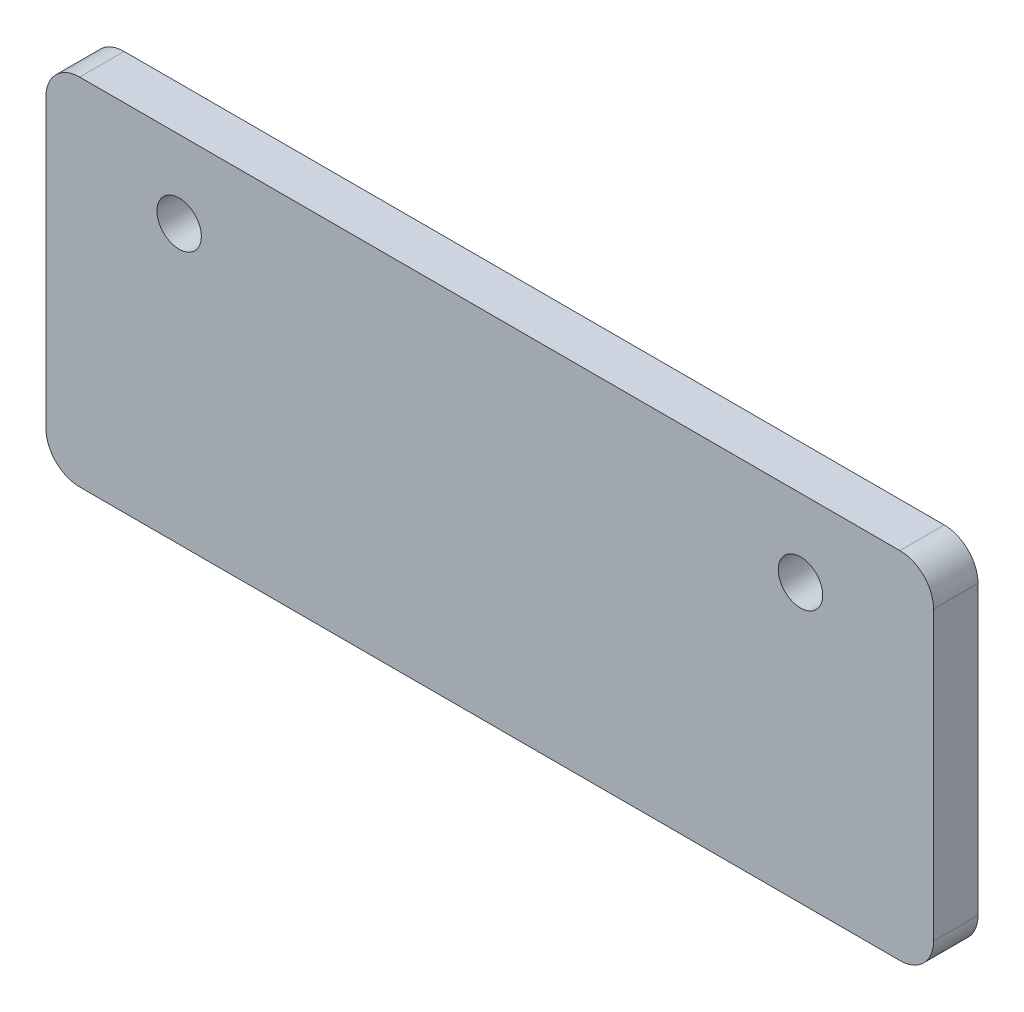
ISO-10303-21;
HEADER;
FILE_DESCRIPTION(('STEP AP214'),'2;1');
FILE_NAME('part.step','',(''),(''),'','','');
FILE_SCHEMA(('AUTOMOTIVE_DESIGN { 1 0 10303 214 1 1 1 1 }'));
ENDSEC;
DATA;
#1=APPLICATION_CONTEXT('core data for automotive mechanical design processes');
#2=APPLICATION_PROTOCOL_DEFINITION('international standard','automotive_design',2000,#1);
#3=PRODUCT_CONTEXT('',#1,'mechanical');
#4=PRODUCT('Part','Part','',(#3));
#5=PRODUCT_RELATED_PRODUCT_CATEGORY('part','',(#4));
#6=PRODUCT_DEFINITION_FORMATION('','',#4);
#7=PRODUCT_DEFINITION_CONTEXT('part definition',#1,'design');
#8=PRODUCT_DEFINITION('design','',#6,#7);
#9=PRODUCT_DEFINITION_SHAPE('','',#8);
#10=(LENGTH_UNIT() NAMED_UNIT(*) SI_UNIT(.MILLI.,.METRE.));
#11=(NAMED_UNIT(*) PLANE_ANGLE_UNIT() SI_UNIT($,.RADIAN.));
#12=(NAMED_UNIT(*) SI_UNIT($,.STERADIAN.) SOLID_ANGLE_UNIT());
#13=UNCERTAINTY_MEASURE_WITH_UNIT(LENGTH_MEASURE(1.E-05),#10,'distance_accuracy_value','');
#14=(GEOMETRIC_REPRESENTATION_CONTEXT(3) GLOBAL_UNCERTAINTY_ASSIGNED_CONTEXT((#13)) GLOBAL_UNIT_ASSIGNED_CONTEXT((#10,
#11,#12)) REPRESENTATION_CONTEXT('',''));
#15=CARTESIAN_POINT('',(0.,0.,0.));
#16=DIRECTION('',(0.,0.,1.));
#17=DIRECTION('',(1.,0.,0.));
#18=AXIS2_PLACEMENT_3D('',#15,#16,#17);
#19=CARTESIAN_POINT('',(244.348,41.148,6.35));
#20=DIRECTION('',(0.,0.,-1.));
#21=DIRECTION('',(-1.,0.,0.));
#22=AXIS2_PLACEMENT_3D('',#19,#20,#21);
#23=PLANE('',#22);
#24=CARTESIAN_POINT('',(215.9,28.702,6.35));
#25=DIRECTION('',(0.,0.,1.));
#26=DIRECTION('',(1.,0.,0.));
#27=AXIS2_PLACEMENT_3D('',#24,#25,#26);
#28=CIRCLE('',#27,6.35);
#29=CARTESIAN_POINT('',(222.25,28.702,6.35));
#30=VERTEX_POINT('',#29);
#31=EDGE_CURVE('E110',#30,#30,#28,.T.);
#32=ORIENTED_EDGE('',*,*,#31,.F.);
#33=EDGE_LOOP('',(#32));
#34=FACE_BOUND('',#33,.T.);
#35=CARTESIAN_POINT('',(244.348,41.148,6.35));
#36=DIRECTION('',(0.,0.,1.));
#37=DIRECTION('',(-1.,0.,0.));
#38=AXIS2_PLACEMENT_3D('',#35,#36,#37);
#39=CIRCLE('',#38,9.652);
#40=CARTESIAN_POINT('',(254.,41.148,6.35));
#41=VERTEX_POINT('',#40);
#42=CARTESIAN_POINT('',(244.348,50.8,6.35));
#43=VERTEX_POINT('',#42);
#44=EDGE_CURVE('E128',#41,#43,#39,.T.);
#45=ORIENTED_EDGE('',*,*,#44,.T.);
#46=DIRECTION('',(-1.,0.,0.));
#47=VECTOR('',#46,1.);
#48=CARTESIAN_POINT('',(9.65199999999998,50.8,6.35));
#49=LINE('',#48,#47);
#50=CARTESIAN_POINT('',(9.65199999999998,50.8,6.35));
#51=VERTEX_POINT('',#50);
#52=EDGE_CURVE('E105',#43,#51,#49,.T.);
#53=ORIENTED_EDGE('',*,*,#52,.T.);
#54=CARTESIAN_POINT('',(9.65199999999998,41.148,6.35));
#55=DIRECTION('',(0.,0.,1.));
#56=DIRECTION('',(-1.,0.,0.));
#57=AXIS2_PLACEMENT_3D('',#54,#55,#56);
#58=CIRCLE('',#57,9.652);
#59=CARTESIAN_POINT('',(0.,41.148,6.35));
#60=VERTEX_POINT('',#59);
#61=EDGE_CURVE('E131',#51,#60,#58,.T.);
#62=ORIENTED_EDGE('',*,*,#61,.T.);
#63=DIRECTION('',(0.,-1.,0.));
#64=VECTOR('',#63,1.);
#65=CARTESIAN_POINT('',(0.,-41.148,6.35));
#66=LINE('',#65,#64);
#67=CARTESIAN_POINT('',(0.,-41.148,6.35));
#68=VERTEX_POINT('',#67);
#69=EDGE_CURVE('E133',#60,#68,#66,.T.);
#70=ORIENTED_EDGE('',*,*,#69,.T.);
#71=CARTESIAN_POINT('',(9.652,-41.148,6.35));
#72=DIRECTION('',(0.,0.,1.));
#73=DIRECTION('',(-1.,0.,0.));
#74=AXIS2_PLACEMENT_3D('',#71,#72,#73);
#75=CIRCLE('',#74,9.652);
#76=CARTESIAN_POINT('',(9.652,-50.8,6.35));
#77=VERTEX_POINT('',#76);
#78=EDGE_CURVE('E135',#68,#77,#75,.T.);
#79=ORIENTED_EDGE('',*,*,#78,.T.);
#80=DIRECTION('',(1.,0.,0.));
#81=VECTOR('',#80,1.);
#82=CARTESIAN_POINT('',(244.348,-50.7999999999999,6.35));
#83=LINE('',#82,#81);
#84=CARTESIAN_POINT('',(244.348,-50.7999999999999,6.35));
#85=VERTEX_POINT('',#84);
#86=EDGE_CURVE('E137',#77,#85,#83,.T.);
#87=ORIENTED_EDGE('',*,*,#86,.T.);
#88=CARTESIAN_POINT('',(244.348,-41.1479999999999,6.35));
#89=DIRECTION('',(0.,0.,1.));
#90=DIRECTION('',(-1.,0.,0.));
#91=AXIS2_PLACEMENT_3D('',#88,#89,#90);
#92=CIRCLE('',#91,9.65199999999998);
#93=CARTESIAN_POINT('',(254.,-41.1479999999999,6.35));
#94=VERTEX_POINT('',#93);
#95=EDGE_CURVE('E46',#85,#94,#92,.T.);
#96=ORIENTED_EDGE('',*,*,#95,.T.);
#97=DIRECTION('',(0.,1.,0.));
#98=VECTOR('',#97,1.);
#99=CARTESIAN_POINT('',(254.,41.148,6.35));
#100=LINE('',#99,#98);
#101=EDGE_CURVE('E41',#94,#41,#100,.T.);
#102=ORIENTED_EDGE('',*,*,#101,.T.);
#103=EDGE_LOOP('',(#45,#53,#62,#70,#79,#87,#96,#102));
#104=FACE_BOUND('',#103,.T.);
#105=CARTESIAN_POINT('',(38.1,28.702,6.35));
#106=DIRECTION('',(0.,0.,1.));
#107=DIRECTION('',(1.,0.,0.));
#108=AXIS2_PLACEMENT_3D('',#105,#106,#107);
#109=CIRCLE('',#108,6.35000000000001);
#110=CARTESIAN_POINT('',(44.45,28.702,6.35));
#111=VERTEX_POINT('',#110);
#112=EDGE_CURVE('E208',#111,#111,#109,.T.);
#113=ORIENTED_EDGE('',*,*,#112,.F.);
#114=EDGE_LOOP('',(#113));
#115=FACE_BOUND('',#114,.T.);
#116=ADVANCED_FACE('F26',(#34,#104,#115),#23,.F.);
#117=CARTESIAN_POINT('',(244.348,41.148,-6.35));
#118=DIRECTION('',(0.,0.,-1.));
#119=DIRECTION('',(-1.,0.,0.));
#120=AXIS2_PLACEMENT_3D('',#117,#118,#119);
#121=PLANE('',#120);
#122=CARTESIAN_POINT('',(215.9,28.702,-6.35));
#123=DIRECTION('',(0.,0.,1.));
#124=DIRECTION('',(1.,0.,0.));
#125=AXIS2_PLACEMENT_3D('',#122,#123,#124);
#126=CIRCLE('',#125,6.35);
#127=CARTESIAN_POINT('',(222.25,28.702,-6.35));
#128=VERTEX_POINT('',#127);
#129=EDGE_CURVE('E113',#128,#128,#126,.T.);
#130=ORIENTED_EDGE('',*,*,#129,.T.);
#131=EDGE_LOOP('',(#130));
#132=FACE_BOUND('',#131,.T.);
#133=CARTESIAN_POINT('',(244.348,41.148,-6.35));
#134=DIRECTION('',(0.,0.,1.));
#135=DIRECTION('',(-1.,0.,0.));
#136=AXIS2_PLACEMENT_3D('',#133,#134,#135);
#137=CIRCLE('',#136,9.652);
#138=CARTESIAN_POINT('',(254.,41.148,-6.35));
#139=VERTEX_POINT('',#138);
#140=CARTESIAN_POINT('',(244.348,50.8,-6.35));
#141=VERTEX_POINT('',#140);
#142=EDGE_CURVE('E96',#139,#141,#137,.T.);
#143=ORIENTED_EDGE('',*,*,#142,.F.);
#144=DIRECTION('',(0.,1.,0.));
#145=VECTOR('',#144,1.);
#146=CARTESIAN_POINT('',(254.,41.148,-6.35));
#147=LINE('',#146,#145);
#148=CARTESIAN_POINT('',(254.,-41.1479999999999,-6.35));
#149=VERTEX_POINT('',#148);
#150=EDGE_CURVE('E126',#149,#139,#147,.T.);
#151=ORIENTED_EDGE('',*,*,#150,.F.);
#152=CARTESIAN_POINT('',(244.348,-41.1479999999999,-6.35));
#153=DIRECTION('',(0.,0.,1.));
#154=DIRECTION('',(-1.,0.,0.));
#155=AXIS2_PLACEMENT_3D('',#152,#153,#154);
#156=CIRCLE('',#155,9.65199999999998);
#157=CARTESIAN_POINT('',(244.348,-50.7999999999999,-6.35));
#158=VERTEX_POINT('',#157);
#159=EDGE_CURVE('E124',#158,#149,#156,.T.);
#160=ORIENTED_EDGE('',*,*,#159,.F.);
#161=DIRECTION('',(1.,0.,0.));
#162=VECTOR('',#161,1.);
#163=CARTESIAN_POINT('',(244.348,-50.7999999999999,-6.35));
#164=LINE('',#163,#162);
#165=CARTESIAN_POINT('',(9.652,-50.8,-6.35));
#166=VERTEX_POINT('',#165);
#167=EDGE_CURVE('E122',#166,#158,#164,.T.);
#168=ORIENTED_EDGE('',*,*,#167,.F.);
#169=CARTESIAN_POINT('',(9.652,-41.148,-6.35));
#170=DIRECTION('',(0.,0.,1.));
#171=DIRECTION('',(-1.,0.,0.));
#172=AXIS2_PLACEMENT_3D('',#169,#170,#171);
#173=CIRCLE('',#172,9.652);
#174=CARTESIAN_POINT('',(0.,-41.148,-6.35));
#175=VERTEX_POINT('',#174);
#176=EDGE_CURVE('E120',#175,#166,#173,.T.);
#177=ORIENTED_EDGE('',*,*,#176,.F.);
#178=DIRECTION('',(0.,-1.,0.));
#179=VECTOR('',#178,1.);
#180=CARTESIAN_POINT('',(0.,-41.148,-6.35));
#181=LINE('',#180,#179);
#182=CARTESIAN_POINT('',(0.,41.148,-6.35));
#183=VERTEX_POINT('',#182);
#184=EDGE_CURVE('E118',#183,#175,#181,.T.);
#185=ORIENTED_EDGE('',*,*,#184,.F.);
#186=CARTESIAN_POINT('',(9.65199999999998,41.148,-6.35));
#187=DIRECTION('',(0.,0.,1.));
#188=DIRECTION('',(-1.,0.,0.));
#189=AXIS2_PLACEMENT_3D('',#186,#187,#188);
#190=CIRCLE('',#189,9.652);
#191=CARTESIAN_POINT('',(9.65199999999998,50.8,-6.35));
#192=VERTEX_POINT('',#191);
#193=EDGE_CURVE('E98',#192,#183,#190,.T.);
#194=ORIENTED_EDGE('',*,*,#193,.F.);
#195=DIRECTION('',(-1.,0.,0.));
#196=VECTOR('',#195,1.);
#197=CARTESIAN_POINT('',(9.65199999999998,50.8,-6.35));
#198=LINE('',#197,#196);
#199=EDGE_CURVE('E91',#141,#192,#198,.T.);
#200=ORIENTED_EDGE('',*,*,#199,.F.);
#201=EDGE_LOOP('',(#143,#151,#160,#168,#177,#185,#194,#200));
#202=FACE_BOUND('',#201,.T.);
#203=CARTESIAN_POINT('',(38.1,28.702,-6.35));
#204=DIRECTION('',(0.,0.,1.));
#205=DIRECTION('',(1.,0.,0.));
#206=AXIS2_PLACEMENT_3D('',#203,#204,#205);
#207=CIRCLE('',#206,6.35000000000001);
#208=CARTESIAN_POINT('',(44.45,28.702,-6.35));
#209=VERTEX_POINT('',#208);
#210=EDGE_CURVE('E211',#209,#209,#207,.T.);
#211=ORIENTED_EDGE('',*,*,#210,.T.);
#212=EDGE_LOOP('',(#211));
#213=FACE_BOUND('',#212,.T.);
#214=ADVANCED_FACE('F92',(#132,#202,#213),#121,.T.);
#215=CARTESIAN_POINT('',(244.348,41.148,6.35));
#216=DIRECTION('',(0.,0.,-1.));
#217=DIRECTION('',(-1.,0.,0.));
#218=AXIS2_PLACEMENT_3D('',#215,#216,#217);
#219=CYLINDRICAL_SURFACE('',#218,9.652);
#220=ORIENTED_EDGE('',*,*,#142,.T.);
#221=DIRECTION('',(0.,0.,-1.));
#222=VECTOR('',#221,1.);
#223=CARTESIAN_POINT('',(244.348,50.8,6.35));
#224=LINE('',#223,#222);
#225=EDGE_CURVE('E11',#43,#141,#224,.T.);
#226=ORIENTED_EDGE('',*,*,#225,.F.);
#227=ORIENTED_EDGE('',*,*,#44,.F.);
#228=DIRECTION('',(0.,0.,-1.));
#229=VECTOR('',#228,1.);
#230=CARTESIAN_POINT('',(254.,41.148,6.35));
#231=LINE('',#230,#229);
#232=EDGE_CURVE('E109',#41,#139,#231,.T.);
#233=ORIENTED_EDGE('',*,*,#232,.T.);
#234=EDGE_LOOP('',(#220,#226,#227,#233));
#235=FACE_BOUND('',#234,.T.);
#236=ADVANCED_FACE('F28',(#235),#219,.T.);
#237=CARTESIAN_POINT('',(9.65199999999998,50.8,6.35));
#238=DIRECTION('',(0.,-1.,0.));
#239=DIRECTION('',(0.,0.,-1.));
#240=AXIS2_PLACEMENT_3D('',#237,#238,#239);
#241=PLANE('',#240);
#242=ORIENTED_EDGE('',*,*,#199,.T.);
#243=DIRECTION('',(0.,0.,-1.));
#244=VECTOR('',#243,1.);
#245=CARTESIAN_POINT('',(9.65199999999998,50.8,6.35));
#246=LINE('',#245,#244);
#247=EDGE_CURVE('E34',#51,#192,#246,.T.);
#248=ORIENTED_EDGE('',*,*,#247,.F.);
#249=ORIENTED_EDGE('',*,*,#52,.F.);
#250=ORIENTED_EDGE('',*,*,#225,.T.);
#251=EDGE_LOOP('',(#242,#248,#249,#250));
#252=FACE_BOUND('',#251,.T.);
#253=ADVANCED_FACE('F104',(#252),#241,.F.);
#254=CARTESIAN_POINT('',(9.65199999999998,41.148,6.35));
#255=DIRECTION('',(0.,0.,-1.));
#256=DIRECTION('',(-1.,0.,0.));
#257=AXIS2_PLACEMENT_3D('',#254,#255,#256);
#258=CYLINDRICAL_SURFACE('',#257,9.652);
#259=ORIENTED_EDGE('',*,*,#193,.T.);
#260=DIRECTION('',(0.,0.,-1.));
#261=VECTOR('',#260,1.);
#262=CARTESIAN_POINT('',(0.,41.148,6.35));
#263=LINE('',#262,#261);
#264=EDGE_CURVE('E154',#60,#183,#263,.T.);
#265=ORIENTED_EDGE('',*,*,#264,.F.);
#266=ORIENTED_EDGE('',*,*,#61,.F.);
#267=ORIENTED_EDGE('',*,*,#247,.T.);
#268=EDGE_LOOP('',(#259,#265,#266,#267));
#269=FACE_BOUND('',#268,.T.);
#270=ADVANCED_FACE('F158',(#269),#258,.T.);
#271=CARTESIAN_POINT('',(0.,-41.148,6.35));
#272=DIRECTION('',(1.,0.,0.));
#273=DIRECTION('',(0.,1.,0.));
#274=AXIS2_PLACEMENT_3D('',#271,#272,#273);
#275=PLANE('',#274);
#276=ORIENTED_EDGE('',*,*,#184,.T.);
#277=DIRECTION('',(0.,0.,-1.));
#278=VECTOR('',#277,1.);
#279=CARTESIAN_POINT('',(0.,-41.148,6.35));
#280=LINE('',#279,#278);
#281=EDGE_CURVE('E151',#68,#175,#280,.T.);
#282=ORIENTED_EDGE('',*,*,#281,.F.);
#283=ORIENTED_EDGE('',*,*,#69,.F.);
#284=ORIENTED_EDGE('',*,*,#264,.T.);
#285=EDGE_LOOP('',(#276,#282,#283,#284));
#286=FACE_BOUND('',#285,.T.);
#287=ADVANCED_FACE('F166',(#286),#275,.F.);
#288=CARTESIAN_POINT('',(9.652,-41.148,6.35));
#289=DIRECTION('',(0.,0.,-1.));
#290=DIRECTION('',(-1.,0.,0.));
#291=AXIS2_PLACEMENT_3D('',#288,#289,#290);
#292=CYLINDRICAL_SURFACE('',#291,9.652);
#293=ORIENTED_EDGE('',*,*,#176,.T.);
#294=DIRECTION('',(0.,0.,-1.));
#295=VECTOR('',#294,1.);
#296=CARTESIAN_POINT('',(9.652,-50.8,6.35));
#297=LINE('',#296,#295);
#298=EDGE_CURVE('E148',#77,#166,#297,.T.);
#299=ORIENTED_EDGE('',*,*,#298,.F.);
#300=ORIENTED_EDGE('',*,*,#78,.F.);
#301=ORIENTED_EDGE('',*,*,#281,.T.);
#302=EDGE_LOOP('',(#293,#299,#300,#301));
#303=FACE_BOUND('',#302,.T.);
#304=ADVANCED_FACE('F169',(#303),#292,.T.);
#305=CARTESIAN_POINT('',(244.348,-50.7999999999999,6.35));
#306=DIRECTION('',(0.,1.,0.));
#307=DIRECTION('',(-1.,0.,0.));
#308=AXIS2_PLACEMENT_3D('',#305,#306,#307);
#309=PLANE('',#308);
#310=ORIENTED_EDGE('',*,*,#167,.T.);
#311=DIRECTION('',(0.,0.,-1.));
#312=VECTOR('',#311,1.);
#313=CARTESIAN_POINT('',(244.348,-50.7999999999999,6.35));
#314=LINE('',#313,#312);
#315=EDGE_CURVE('E145',#85,#158,#314,.T.);
#316=ORIENTED_EDGE('',*,*,#315,.F.);
#317=ORIENTED_EDGE('',*,*,#86,.F.);
#318=ORIENTED_EDGE('',*,*,#298,.T.);
#319=EDGE_LOOP('',(#310,#316,#317,#318));
#320=FACE_BOUND('',#319,.T.);
#321=ADVANCED_FACE('F174',(#320),#309,.F.);
#322=CARTESIAN_POINT('',(244.348,-41.1479999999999,6.35));
#323=DIRECTION('',(0.,0.,-1.));
#324=DIRECTION('',(-1.,0.,0.));
#325=AXIS2_PLACEMENT_3D('',#322,#323,#324);
#326=CYLINDRICAL_SURFACE('',#325,9.65199999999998);
#327=ORIENTED_EDGE('',*,*,#159,.T.);
#328=DIRECTION('',(0.,0.,-1.));
#329=VECTOR('',#328,1.);
#330=CARTESIAN_POINT('',(254.,-41.1479999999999,6.35));
#331=LINE('',#330,#329);
#332=EDGE_CURVE('E142',#94,#149,#331,.T.);
#333=ORIENTED_EDGE('',*,*,#332,.F.);
#334=ORIENTED_EDGE('',*,*,#95,.F.);
#335=ORIENTED_EDGE('',*,*,#315,.T.);
#336=EDGE_LOOP('',(#327,#333,#334,#335));
#337=FACE_BOUND('',#336,.T.);
#338=ADVANCED_FACE('F177',(#337),#326,.T.);
#339=CARTESIAN_POINT('',(254.,41.148,6.35));
#340=DIRECTION('',(-1.,0.,0.));
#341=DIRECTION('',(0.,0.,1.));
#342=AXIS2_PLACEMENT_3D('',#339,#340,#341);
#343=PLANE('',#342);
#344=ORIENTED_EDGE('',*,*,#150,.T.);
#345=ORIENTED_EDGE('',*,*,#232,.F.);
#346=ORIENTED_EDGE('',*,*,#101,.F.);
#347=ORIENTED_EDGE('',*,*,#332,.T.);
#348=EDGE_LOOP('',(#344,#345,#346,#347));
#349=FACE_BOUND('',#348,.T.);
#350=ADVANCED_FACE('F179',(#349),#343,.F.);
#351=CARTESIAN_POINT('',(215.9,28.702,6.35));
#352=DIRECTION('',(0.,0.,-1.));
#353=DIRECTION('',(-1.,0.,0.));
#354=AXIS2_PLACEMENT_3D('',#351,#352,#353);
#355=CYLINDRICAL_SURFACE('',#354,6.35);
#356=ORIENTED_EDGE('',*,*,#31,.T.);
#357=EDGE_LOOP('',(#356));
#358=FACE_BOUND('',#357,.T.);
#359=ORIENTED_EDGE('',*,*,#129,.F.);
#360=EDGE_LOOP('',(#359));
#361=FACE_BOUND('',#360,.T.);
#362=ADVANCED_FACE('F181',(#358,#361),#355,.F.);
#363=CARTESIAN_POINT('',(38.1,28.702,6.35));
#364=DIRECTION('',(0.,0.,-1.));
#365=DIRECTION('',(-1.,0.,0.));
#366=AXIS2_PLACEMENT_3D('',#363,#364,#365);
#367=CYLINDRICAL_SURFACE('',#366,6.35000000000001);
#368=ORIENTED_EDGE('',*,*,#112,.T.);
#369=EDGE_LOOP('',(#368));
#370=FACE_BOUND('',#369,.T.);
#371=ORIENTED_EDGE('',*,*,#210,.F.);
#372=EDGE_LOOP('',(#371));
#373=FACE_BOUND('',#372,.T.);
#374=ADVANCED_FACE('F187',(#370,#373),#367,.F.);
#375=CLOSED_SHELL('',(#116,#214,#236,#253,#270,#287,#304,#321,#338,#350,#362,#374));
#376=MANIFOLD_SOLID_BREP('B2',#375);
#377=ADVANCED_BREP_SHAPE_REPRESENTATION('',(#18,#376),#14);
#378=SHAPE_DEFINITION_REPRESENTATION(#9,#377);
ENDSEC;
END-ISO-10303-21;
